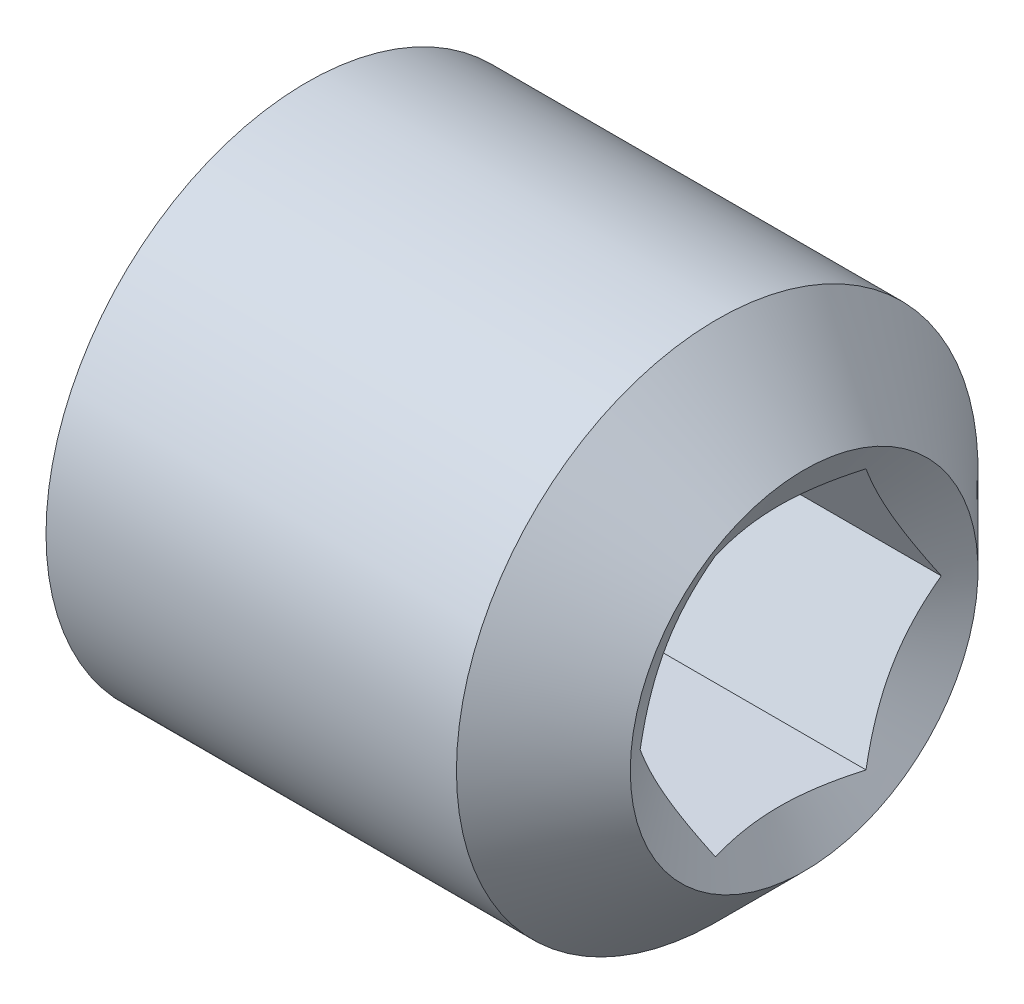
from build123d import *

# Parameters (mm, degrees)
HEX_2_DEPTH = 15.696938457


with BuildPart() as part:
    # BodySke → BaseBody (revolve)
    with BuildSketch(Plane.XY, mode=Mode.PRIVATE) as basebody_sk:
        Polygon((0, 0), (0, 5.036), (0.556565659, 6), (10, 6), (12, 4), (9.690598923, 0), align=None)
    revolve(basebody_sk.sketch.rotate(Axis((-12.7, 0, 0), (1, 0, 0)), 90), axis=Axis((-12.7, 0, 0), (1, 0, 0)))

    # Sketch2 → Hex 2 (cut, through all)
    with BuildSketch(Plane.ZY):
        Polygon((1.732050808, 3), (-1.732050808, 3), (-3.464101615, 0), (-1.732050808, -3), (1.732050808, -3), (3.464101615, 0), align=None)
    extrude(amount=-HEX_2_DEPTH, mode=Mode.SUBTRACT)


solid = part.part
